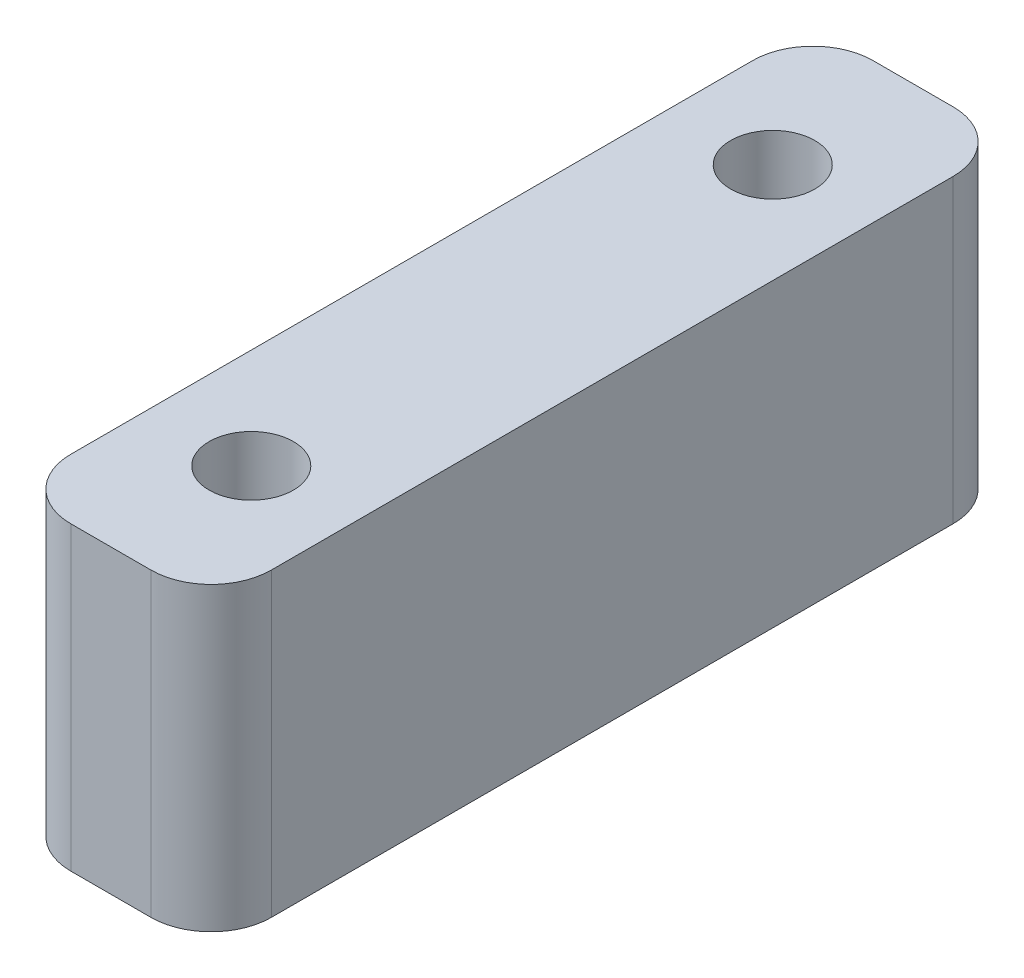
ISO-10303-21;
HEADER;
FILE_DESCRIPTION(('STEP AP214'),'2;1');
FILE_NAME('part.step','',(''),(''),'','','');
FILE_SCHEMA(('AUTOMOTIVE_DESIGN { 1 0 10303 214 1 1 1 1 }'));
ENDSEC;
DATA;
#1=APPLICATION_CONTEXT('core data for automotive mechanical design processes');
#2=APPLICATION_PROTOCOL_DEFINITION('international standard','automotive_design',2000,#1);
#3=PRODUCT_CONTEXT('',#1,'mechanical');
#4=PRODUCT('Part','Part','',(#3));
#5=PRODUCT_RELATED_PRODUCT_CATEGORY('part','',(#4));
#6=PRODUCT_DEFINITION_FORMATION('','',#4);
#7=PRODUCT_DEFINITION_CONTEXT('part definition',#1,'design');
#8=PRODUCT_DEFINITION('design','',#6,#7);
#9=PRODUCT_DEFINITION_SHAPE('','',#8);
#10=(LENGTH_UNIT() NAMED_UNIT(*) SI_UNIT(.MILLI.,.METRE.));
#11=(NAMED_UNIT(*) PLANE_ANGLE_UNIT() SI_UNIT($,.RADIAN.));
#12=(NAMED_UNIT(*) SI_UNIT($,.STERADIAN.) SOLID_ANGLE_UNIT());
#13=UNCERTAINTY_MEASURE_WITH_UNIT(LENGTH_MEASURE(1.E-05),#10,'distance_accuracy_value','');
#14=(GEOMETRIC_REPRESENTATION_CONTEXT(3) GLOBAL_UNCERTAINTY_ASSIGNED_CONTEXT((#13)) GLOBAL_UNIT_ASSIGNED_CONTEXT((#10,
#11,#12)) REPRESENTATION_CONTEXT('',''));
#15=CARTESIAN_POINT('',(0.,0.,0.));
#16=DIRECTION('',(0.,0.,1.));
#17=DIRECTION('',(1.,0.,0.));
#18=AXIS2_PLACEMENT_3D('',#15,#16,#17);
#19=CARTESIAN_POINT('',(0.,15.,0.));
#20=DIRECTION('',(0.,1.,0.));
#21=DIRECTION('',(0.,0.,1.));
#22=AXIS2_PLACEMENT_3D('',#19,#20,#21);
#23=PLANE('',#22);
#24=CARTESIAN_POINT('',(-5.,15.,7.));
#25=DIRECTION('',(0.,1.,0.));
#26=DIRECTION('',(0.,0.,1.));
#27=AXIS2_PLACEMENT_3D('',#24,#25,#26);
#28=CIRCLE('',#27,2.1);
#29=CARTESIAN_POINT('',(-5.,15.,9.1));
#30=VERTEX_POINT('',#29);
#31=EDGE_CURVE('E144',#30,#30,#28,.T.);
#32=ORIENTED_EDGE('',*,*,#31,.F.);
#33=EDGE_LOOP('',(#32));
#34=FACE_BOUND('',#33,.T.);
#35=DIRECTION('',(0.,0.,1.));
#36=VECTOR('',#35,1.);
#37=CARTESIAN_POINT('',(-10.,15.,0.));
#38=LINE('',#37,#36);
#39=CARTESIAN_POINT('',(-10.,15.,3.));
#40=VERTEX_POINT('',#39);
#41=CARTESIAN_POINT('',(-9.99999999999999,15.,37.));
#42=VERTEX_POINT('',#41);
#43=EDGE_CURVE('E150',#40,#42,#38,.T.);
#44=ORIENTED_EDGE('',*,*,#43,.T.);
#45=CARTESIAN_POINT('',(-7.,15.,37.));
#46=DIRECTION('',(0.,1.,0.));
#47=DIRECTION('',(0.,0.,1.));
#48=AXIS2_PLACEMENT_3D('',#45,#46,#47);
#49=CIRCLE('',#48,3.);
#50=CARTESIAN_POINT('',(-7.,15.,40.));
#51=VERTEX_POINT('',#50);
#52=EDGE_CURVE('E174',#42,#51,#49,.T.);
#53=ORIENTED_EDGE('',*,*,#52,.T.);
#54=DIRECTION('',(1.,0.,0.));
#55=VECTOR('',#54,1.);
#56=CARTESIAN_POINT('',(-9.99999999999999,15.,40.));
#57=LINE('',#56,#55);
#58=CARTESIAN_POINT('',(-3.,15.,40.));
#59=VERTEX_POINT('',#58);
#60=EDGE_CURVE('E127',#51,#59,#57,.T.);
#61=ORIENTED_EDGE('',*,*,#60,.T.);
#62=CARTESIAN_POINT('',(-3.,15.,37.));
#63=DIRECTION('',(0.,1.,0.));
#64=DIRECTION('',(0.,0.,1.));
#65=AXIS2_PLACEMENT_3D('',#62,#63,#64);
#66=CIRCLE('',#65,3.);
#67=CARTESIAN_POINT('',(0.,15.,37.));
#68=VERTEX_POINT('',#67);
#69=EDGE_CURVE('E171',#59,#68,#66,.T.);
#70=ORIENTED_EDGE('',*,*,#69,.T.);
#71=DIRECTION('',(0.,0.,-1.));
#72=VECTOR('',#71,1.);
#73=CARTESIAN_POINT('',(0.,15.,0.));
#74=LINE('',#73,#72);
#75=CARTESIAN_POINT('',(0.,15.,3.));
#76=VERTEX_POINT('',#75);
#77=EDGE_CURVE('E186',#68,#76,#74,.T.);
#78=ORIENTED_EDGE('',*,*,#77,.T.);
#79=CARTESIAN_POINT('',(-3.,15.,3.));
#80=DIRECTION('',(0.,1.,0.));
#81=DIRECTION('',(0.,0.,1.));
#82=AXIS2_PLACEMENT_3D('',#79,#80,#81);
#83=CIRCLE('',#82,3.);
#84=CARTESIAN_POINT('',(-3.,15.,0.));
#85=VERTEX_POINT('',#84);
#86=EDGE_CURVE('E61',#76,#85,#83,.T.);
#87=ORIENTED_EDGE('',*,*,#86,.T.);
#88=DIRECTION('',(-1.,0.,0.));
#89=VECTOR('',#88,1.);
#90=CARTESIAN_POINT('',(-10.,15.,0.));
#91=LINE('',#90,#89);
#92=CARTESIAN_POINT('',(-7.,15.,0.));
#93=VERTEX_POINT('',#92);
#94=EDGE_CURVE('E152',#85,#93,#91,.T.);
#95=ORIENTED_EDGE('',*,*,#94,.T.);
#96=CARTESIAN_POINT('',(-7.,15.,3.));
#97=DIRECTION('',(0.,1.,0.));
#98=DIRECTION('',(0.,0.,1.));
#99=AXIS2_PLACEMENT_3D('',#96,#97,#98);
#100=CIRCLE('',#99,3.);
#101=EDGE_CURVE('E166',#93,#40,#100,.T.);
#102=ORIENTED_EDGE('',*,*,#101,.T.);
#103=EDGE_LOOP('',(#44,#53,#61,#70,#78,#87,#95,#102));
#104=FACE_BOUND('',#103,.T.);
#105=CARTESIAN_POINT('',(-5.,15.,33.));
#106=DIRECTION('',(0.,1.,0.));
#107=DIRECTION('',(0.,0.,1.));
#108=AXIS2_PLACEMENT_3D('',#105,#106,#107);
#109=CIRCLE('',#108,2.1);
#110=CARTESIAN_POINT('',(-5.,15.,35.1));
#111=VERTEX_POINT('',#110);
#112=EDGE_CURVE('E199',#111,#111,#109,.T.);
#113=ORIENTED_EDGE('',*,*,#112,.F.);
#114=EDGE_LOOP('',(#113));
#115=FACE_BOUND('',#114,.T.);
#116=ADVANCED_FACE('F39',(#34,#104,#115),#23,.T.);
#117=CARTESIAN_POINT('',(0.,0.,0.));
#118=DIRECTION('',(0.,1.,0.));
#119=DIRECTION('',(0.,0.,1.));
#120=AXIS2_PLACEMENT_3D('',#117,#118,#119);
#121=PLANE('',#120);
#122=DIRECTION('',(1.,0.,0.));
#123=VECTOR('',#122,1.);
#124=CARTESIAN_POINT('',(-9.99999999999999,0.,40.));
#125=LINE('',#124,#123);
#126=CARTESIAN_POINT('',(-7.,0.,40.));
#127=VERTEX_POINT('',#126);
#128=CARTESIAN_POINT('',(-3.,0.,40.));
#129=VERTEX_POINT('',#128);
#130=EDGE_CURVE('E124',#127,#129,#125,.T.);
#131=ORIENTED_EDGE('',*,*,#130,.F.);
#132=CARTESIAN_POINT('',(-7.,0.,37.));
#133=DIRECTION('',(0.,1.,0.));
#134=DIRECTION('',(0.,0.,1.));
#135=AXIS2_PLACEMENT_3D('',#132,#133,#134);
#136=CIRCLE('',#135,3.);
#137=CARTESIAN_POINT('',(-9.99999999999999,0.,37.));
#138=VERTEX_POINT('',#137);
#139=EDGE_CURVE('E106',#127,#138,#136,.F.);
#140=ORIENTED_EDGE('',*,*,#139,.T.);
#141=DIRECTION('',(0.,0.,1.));
#142=VECTOR('',#141,1.);
#143=CARTESIAN_POINT('',(-10.,0.,0.));
#144=LINE('',#143,#142);
#145=CARTESIAN_POINT('',(-10.,0.,3.));
#146=VERTEX_POINT('',#145);
#147=EDGE_CURVE('E137',#146,#138,#144,.T.);
#148=ORIENTED_EDGE('',*,*,#147,.F.);
#149=CARTESIAN_POINT('',(-7.,0.,3.));
#150=DIRECTION('',(0.,1.,0.));
#151=DIRECTION('',(0.,0.,1.));
#152=AXIS2_PLACEMENT_3D('',#149,#150,#151);
#153=CIRCLE('',#152,3.);
#154=CARTESIAN_POINT('',(-7.,0.,0.));
#155=VERTEX_POINT('',#154);
#156=EDGE_CURVE('E129',#146,#155,#153,.F.);
#157=ORIENTED_EDGE('',*,*,#156,.T.);
#158=DIRECTION('',(-1.,0.,0.));
#159=VECTOR('',#158,1.);
#160=CARTESIAN_POINT('',(-10.,0.,0.));
#161=LINE('',#160,#159);
#162=CARTESIAN_POINT('',(-3.,0.,0.));
#163=VERTEX_POINT('',#162);
#164=EDGE_CURVE('E142',#163,#155,#161,.T.);
#165=ORIENTED_EDGE('',*,*,#164,.F.);
#166=CARTESIAN_POINT('',(-3.,0.,3.));
#167=DIRECTION('',(0.,1.,0.));
#168=DIRECTION('',(0.,0.,1.));
#169=AXIS2_PLACEMENT_3D('',#166,#167,#168);
#170=CIRCLE('',#169,3.);
#171=CARTESIAN_POINT('',(0.,0.,3.));
#172=VERTEX_POINT('',#171);
#173=EDGE_CURVE('E156',#163,#172,#170,.F.);
#174=ORIENTED_EDGE('',*,*,#173,.T.);
#175=DIRECTION('',(0.,0.,-1.));
#176=VECTOR('',#175,1.);
#177=CARTESIAN_POINT('',(0.,0.,0.));
#178=LINE('',#177,#176);
#179=CARTESIAN_POINT('',(0.,0.,37.));
#180=VERTEX_POINT('',#179);
#181=EDGE_CURVE('E136',#180,#172,#178,.T.);
#182=ORIENTED_EDGE('',*,*,#181,.F.);
#183=CARTESIAN_POINT('',(-3.,0.,37.));
#184=DIRECTION('',(0.,1.,0.));
#185=DIRECTION('',(0.,0.,1.));
#186=AXIS2_PLACEMENT_3D('',#183,#184,#185);
#187=CIRCLE('',#186,3.);
#188=EDGE_CURVE('E118',#180,#129,#187,.F.);
#189=ORIENTED_EDGE('',*,*,#188,.T.);
#190=EDGE_LOOP('',(#131,#140,#148,#157,#165,#174,#182,#189));
#191=FACE_BOUND('',#190,.T.);
#192=CARTESIAN_POINT('',(-5.,0.,7.));
#193=DIRECTION('',(0.,1.,0.));
#194=DIRECTION('',(0.,0.,1.));
#195=AXIS2_PLACEMENT_3D('',#192,#193,#194);
#196=CIRCLE('',#195,2.1);
#197=CARTESIAN_POINT('',(-5.,0.,9.1));
#198=VERTEX_POINT('',#197);
#199=EDGE_CURVE('E195',#198,#198,#196,.T.);
#200=ORIENTED_EDGE('',*,*,#199,.T.);
#201=EDGE_LOOP('',(#200));
#202=FACE_BOUND('',#201,.T.);
#203=CARTESIAN_POINT('',(-5.,0.,33.));
#204=DIRECTION('',(0.,1.,0.));
#205=DIRECTION('',(0.,0.,1.));
#206=AXIS2_PLACEMENT_3D('',#203,#204,#205);
#207=CIRCLE('',#206,2.1);
#208=CARTESIAN_POINT('',(-5.,0.,35.1));
#209=VERTEX_POINT('',#208);
#210=EDGE_CURVE('E203',#209,#209,#207,.T.);
#211=ORIENTED_EDGE('',*,*,#210,.T.);
#212=EDGE_LOOP('',(#211));
#213=FACE_BOUND('',#212,.T.);
#214=ADVANCED_FACE('F132',(#191,#202,#213),#121,.F.);
#215=CARTESIAN_POINT('',(-10.,15.,0.));
#216=DIRECTION('',(1.,0.,0.));
#217=DIRECTION('',(0.,0.,-1.));
#218=AXIS2_PLACEMENT_3D('',#215,#216,#217);
#219=PLANE('',#218);
#220=ORIENTED_EDGE('',*,*,#147,.T.);
#221=DIRECTION('',(0.,-1.,0.));
#222=VECTOR('',#221,1.);
#223=CARTESIAN_POINT('',(-9.99999999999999,15.,37.));
#224=LINE('',#223,#222);
#225=EDGE_CURVE('E111',#138,#42,#224,.F.);
#226=ORIENTED_EDGE('',*,*,#225,.T.);
#227=ORIENTED_EDGE('',*,*,#43,.F.);
#228=DIRECTION('',(0.,-1.,0.));
#229=VECTOR('',#228,1.);
#230=CARTESIAN_POINT('',(-10.,15.,3.));
#231=LINE('',#230,#229);
#232=EDGE_CURVE('E117',#40,#146,#231,.T.);
#233=ORIENTED_EDGE('',*,*,#232,.T.);
#234=EDGE_LOOP('',(#220,#226,#227,#233));
#235=FACE_BOUND('',#234,.T.);
#236=ADVANCED_FACE('F220',(#235),#219,.F.);
#237=CARTESIAN_POINT('',(-9.99999999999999,15.,40.));
#238=DIRECTION('',(0.,0.,-1.));
#239=DIRECTION('',(-1.,0.,0.));
#240=AXIS2_PLACEMENT_3D('',#237,#238,#239);
#241=PLANE('',#240);
#242=ORIENTED_EDGE('',*,*,#60,.F.);
#243=DIRECTION('',(0.,-1.,0.));
#244=VECTOR('',#243,1.);
#245=CARTESIAN_POINT('',(-7.,15.,40.));
#246=LINE('',#245,#244);
#247=EDGE_CURVE('E110',#51,#127,#246,.T.);
#248=ORIENTED_EDGE('',*,*,#247,.T.);
#249=ORIENTED_EDGE('',*,*,#130,.T.);
#250=DIRECTION('',(0.,-1.,0.));
#251=VECTOR('',#250,1.);
#252=CARTESIAN_POINT('',(-3.,15.,40.));
#253=LINE('',#252,#251);
#254=EDGE_CURVE('E130',#129,#59,#253,.F.);
#255=ORIENTED_EDGE('',*,*,#254,.T.);
#256=EDGE_LOOP('',(#242,#248,#249,#255));
#257=FACE_BOUND('',#256,.T.);
#258=ADVANCED_FACE('F123',(#257),#241,.F.);
#259=CARTESIAN_POINT('',(0.,15.,0.));
#260=DIRECTION('',(-1.,0.,0.));
#261=DIRECTION('',(0.,0.,1.));
#262=AXIS2_PLACEMENT_3D('',#259,#260,#261);
#263=PLANE('',#262);
#264=ORIENTED_EDGE('',*,*,#77,.F.);
#265=DIRECTION('',(0.,-1.,0.));
#266=VECTOR('',#265,1.);
#267=CARTESIAN_POINT('',(0.,15.,37.));
#268=LINE('',#267,#266);
#269=EDGE_CURVE('E180',#68,#180,#268,.T.);
#270=ORIENTED_EDGE('',*,*,#269,.T.);
#271=ORIENTED_EDGE('',*,*,#181,.T.);
#272=DIRECTION('',(0.,-1.,0.));
#273=VECTOR('',#272,1.);
#274=CARTESIAN_POINT('',(0.,15.,3.));
#275=LINE('',#274,#273);
#276=EDGE_CURVE('E177',#172,#76,#275,.F.);
#277=ORIENTED_EDGE('',*,*,#276,.T.);
#278=EDGE_LOOP('',(#264,#270,#271,#277));
#279=FACE_BOUND('',#278,.T.);
#280=ADVANCED_FACE('F230',(#279),#263,.F.);
#281=CARTESIAN_POINT('',(-10.,15.,0.));
#282=DIRECTION('',(0.,0.,1.));
#283=DIRECTION('',(1.,0.,0.));
#284=AXIS2_PLACEMENT_3D('',#281,#282,#283);
#285=PLANE('',#284);
#286=ORIENTED_EDGE('',*,*,#94,.F.);
#287=DIRECTION('',(0.,-1.,0.));
#288=VECTOR('',#287,1.);
#289=CARTESIAN_POINT('',(-3.,15.,0.));
#290=LINE('',#289,#288);
#291=EDGE_CURVE('E11',#85,#163,#290,.T.);
#292=ORIENTED_EDGE('',*,*,#291,.T.);
#293=ORIENTED_EDGE('',*,*,#164,.T.);
#294=DIRECTION('',(0.,-1.,0.));
#295=VECTOR('',#294,1.);
#296=CARTESIAN_POINT('',(-7.,15.,0.));
#297=LINE('',#296,#295);
#298=EDGE_CURVE('E48',#155,#93,#297,.F.);
#299=ORIENTED_EDGE('',*,*,#298,.T.);
#300=EDGE_LOOP('',(#286,#292,#293,#299));
#301=FACE_BOUND('',#300,.T.);
#302=ADVANCED_FACE('F227',(#301),#285,.F.);
#303=CARTESIAN_POINT('',(-5.,15.,7.));
#304=DIRECTION('',(0.,-1.,0.));
#305=DIRECTION('',(0.,0.,-1.));
#306=AXIS2_PLACEMENT_3D('',#303,#304,#305);
#307=CYLINDRICAL_SURFACE('',#306,2.1);
#308=ORIENTED_EDGE('',*,*,#31,.T.);
#309=EDGE_LOOP('',(#308));
#310=FACE_BOUND('',#309,.T.);
#311=ORIENTED_EDGE('',*,*,#199,.F.);
#312=EDGE_LOOP('',(#311));
#313=FACE_BOUND('',#312,.T.);
#314=ADVANCED_FACE('F224',(#310,#313),#307,.F.);
#315=CARTESIAN_POINT('',(-5.,15.,33.));
#316=DIRECTION('',(0.,-1.,0.));
#317=DIRECTION('',(0.,0.,-1.));
#318=AXIS2_PLACEMENT_3D('',#315,#316,#317);
#319=CYLINDRICAL_SURFACE('',#318,2.1);
#320=ORIENTED_EDGE('',*,*,#112,.T.);
#321=EDGE_LOOP('',(#320));
#322=FACE_BOUND('',#321,.T.);
#323=ORIENTED_EDGE('',*,*,#210,.F.);
#324=EDGE_LOOP('',(#323));
#325=FACE_BOUND('',#324,.T.);
#326=ADVANCED_FACE('F211',(#322,#325),#319,.F.);
#327=CARTESIAN_POINT('',(-7.,15.,37.));
#328=DIRECTION('',(0.,-1.,0.));
#329=DIRECTION('',(0.,0.,-1.));
#330=AXIS2_PLACEMENT_3D('',#327,#328,#329);
#331=CYLINDRICAL_SURFACE('',#330,3.);
#332=ORIENTED_EDGE('',*,*,#52,.F.);
#333=ORIENTED_EDGE('',*,*,#225,.F.);
#334=ORIENTED_EDGE('',*,*,#139,.F.);
#335=ORIENTED_EDGE('',*,*,#247,.F.);
#336=EDGE_LOOP('',(#332,#333,#334,#335));
#337=FACE_BOUND('',#336,.T.);
#338=ADVANCED_FACE('F109',(#337),#331,.T.);
#339=CARTESIAN_POINT('',(-3.,15.,37.));
#340=DIRECTION('',(0.,-1.,0.));
#341=DIRECTION('',(0.,0.,-1.));
#342=AXIS2_PLACEMENT_3D('',#339,#340,#341);
#343=CYLINDRICAL_SURFACE('',#342,3.);
#344=ORIENTED_EDGE('',*,*,#69,.F.);
#345=ORIENTED_EDGE('',*,*,#254,.F.);
#346=ORIENTED_EDGE('',*,*,#188,.F.);
#347=ORIENTED_EDGE('',*,*,#269,.F.);
#348=EDGE_LOOP('',(#344,#345,#346,#347));
#349=FACE_BOUND('',#348,.T.);
#350=ADVANCED_FACE('F241',(#349),#343,.T.);
#351=CARTESIAN_POINT('',(-3.,15.,3.));
#352=DIRECTION('',(0.,-1.,0.));
#353=DIRECTION('',(0.,0.,-1.));
#354=AXIS2_PLACEMENT_3D('',#351,#352,#353);
#355=CYLINDRICAL_SURFACE('',#354,3.);
#356=ORIENTED_EDGE('',*,*,#86,.F.);
#357=ORIENTED_EDGE('',*,*,#276,.F.);
#358=ORIENTED_EDGE('',*,*,#173,.F.);
#359=ORIENTED_EDGE('',*,*,#291,.F.);
#360=EDGE_LOOP('',(#356,#357,#358,#359));
#361=FACE_BOUND('',#360,.T.);
#362=ADVANCED_FACE('F243',(#361),#355,.T.);
#363=CARTESIAN_POINT('',(-7.,15.,3.));
#364=DIRECTION('',(0.,-1.,0.));
#365=DIRECTION('',(0.,0.,-1.));
#366=AXIS2_PLACEMENT_3D('',#363,#364,#365);
#367=CYLINDRICAL_SURFACE('',#366,3.);
#368=ORIENTED_EDGE('',*,*,#101,.F.);
#369=ORIENTED_EDGE('',*,*,#298,.F.);
#370=ORIENTED_EDGE('',*,*,#156,.F.);
#371=ORIENTED_EDGE('',*,*,#232,.F.);
#372=EDGE_LOOP('',(#368,#369,#370,#371));
#373=FACE_BOUND('',#372,.T.);
#374=ADVANCED_FACE('F41',(#373),#367,.T.);
#375=CLOSED_SHELL('',(#116,#214,#236,#258,#280,#302,#314,#326,#338,#350,#362,#374));
#376=MANIFOLD_SOLID_BREP('B2',#375);
#377=ADVANCED_BREP_SHAPE_REPRESENTATION('',(#18,#376),#14);
#378=SHAPE_DEFINITION_REPRESENTATION(#9,#377);
ENDSEC;
END-ISO-10303-21;
